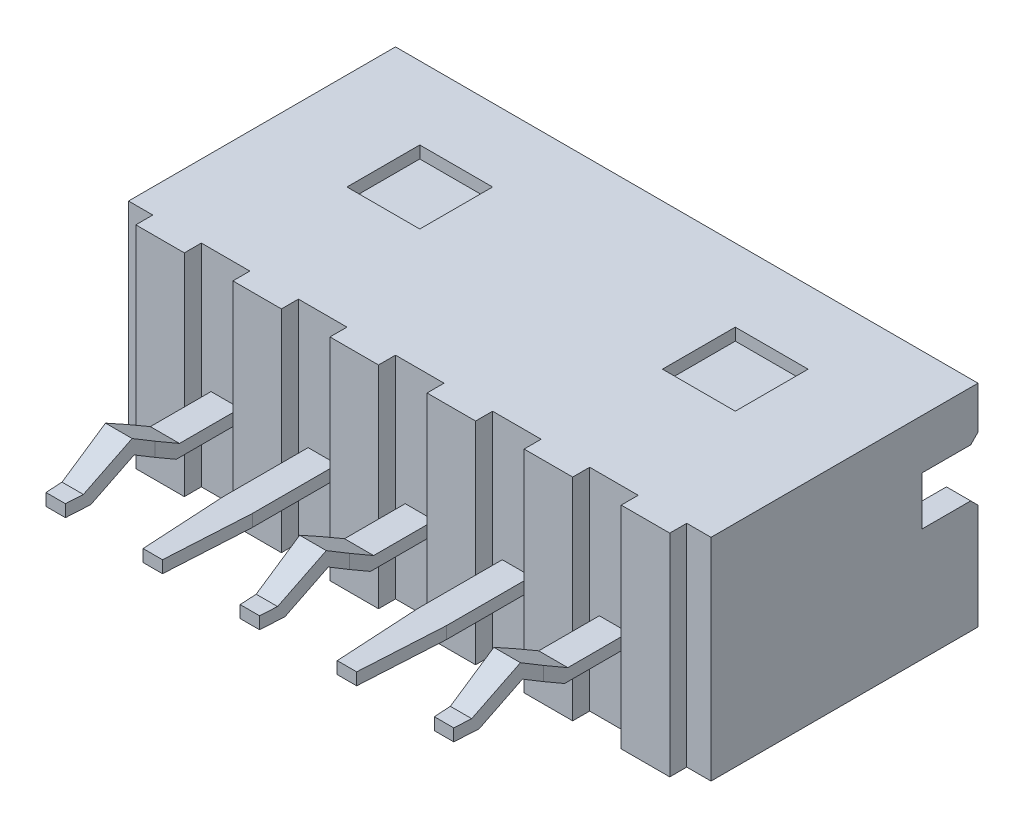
from build123d import *

# Parameters (mm, degrees)
SKETCH1_W           = 12
SKETCH1_H           = 4.35
BOSS_EXTRUDE1_DEPTH = 2.85
SKETCH3_W           = 12
SKETCH3_H           = 4.35
BOSS_EXTRUDE2_DEPTH = 2.65
SKETCH4_W           = 1
SKETCH4_H           = 0.35
BOSS_EXTRUDE3_DEPTH = 4.35
SKETCH5_W           = 0.3
SKETCH5_H           = 1.5
BOSS_EXTRUDE4_DEPTH = 2.85
SKETCH6_W           = 1.5
SKETCH6_H           = 1.5
CUT_EXTRUDE1_DEPTH  = 0.25
CUT_EXTRUDE2_DEPTH  = 0.5
CUT_EXTRUDE3_DEPTH  = 0.5
CUT_EXTRUDE4_START  = -8.3
CUT_EXTRUDE4_DEPTH  = 8.3
CHAMFER6_SIZE       = 0.375
SKETCH10_W          = 0.6
SKETCH10_H          = 3.5
BOSS_EXTRUDE5_DEPTH = 0.8
CUT_EXTRUDE7_REACH  = 15.85
CUT_EXTRUDE8_REACH  = 13.199
CUT_EXTRUDE9_REACH  = 15.85
CUT_EXTRUDE10_REACH = 14.042
SKETCH16_W          = 3.5
SKETCH16_H          = 0.55
CUT_EXTRUDE11_REACH = 14.435
SKETCH17_W          = 3.5
SKETCH17_H          = 0.55
CUT_EXTRUDE12_START = -0.25
CUT_EXTRUDE12_DEPTH = 0.8


with BuildPart() as part:
    # Sketch1 → Boss-Extrude1 (new body)
    with BuildSketch(Plane.XY):
        Rectangle(SKETCH1_W, SKETCH1_H)
        Polygon((-5.5, 1.675), (-5.5, -1.175), (-5.25, -1.175), (-5, -1.675), (5, -1.675), (5.25, -1.175), (5.5, -1.175), (5.5, 1.675), align=None, mode=Mode.SUBTRACT)
    extrude(amount=BOSS_EXTRUDE1_DEPTH)

    # Sketch3 → Boss-Extrude2 (add)
    with BuildSketch(Plane.XY.offset(2.85)):
        Rectangle(SKETCH3_W, SKETCH3_H)
    extrude(amount=BOSS_EXTRUDE2_DEPTH)

    # Sketch4 → Boss-Extrude3 (add)
    with BuildSketch(Plane(origin=(0, 2.175, 0), x_dir=(1, 0, 0), z_dir=(0, 1, 0))):
        with Locations((-5, -5.675)):
            Rectangle(SKETCH4_W, SKETCH4_H)
        with Locations((-3, -5.675)):
            Rectangle(SKETCH4_W, SKETCH4_H)
        with Locations((-1, -5.675)):
            Rectangle(SKETCH4_W, SKETCH4_H)
        with Locations((1, -5.675)):
            Rectangle(SKETCH4_W, SKETCH4_H)
        with Locations((3, -5.675)):
            Rectangle(SKETCH4_W, SKETCH4_H)
        with Locations((5, -5.675)):
            Rectangle(SKETCH4_W, SKETCH4_H)
    extrude(amount=-BOSS_EXTRUDE3_DEPTH)

    # Sketch5 → Boss-Extrude4 (add)
    with BuildSketch(Plane(origin=(0, 0, 2.85), x_dir=(-1, 0, 0), z_dir=(0, 0, -1))):
        with Locations((-4, 0)):
            Rectangle(SKETCH5_W, SKETCH5_H)
        with Locations((-2, 0)):
            Rectangle(SKETCH5_W, SKETCH5_H)
        Rectangle(SKETCH5_W, SKETCH5_H)
        with Locations((2, 0)):
            Rectangle(SKETCH5_W, SKETCH5_H)
        with Locations((4, 0)):
            Rectangle(SKETCH5_W, SKETCH5_H)
    extrude(amount=BOSS_EXTRUDE4_DEPTH)

    # Sketch6 → Cut-Extrude1 (cut)
    with BuildSketch(Plane(origin=(0, 2.175, 0), x_dir=(1, 0, 0), z_dir=(0, 1, 0))):
        with Locations((-3.25, -2.25)):
            Rectangle(SKETCH6_W, SKETCH6_H)
        with Locations((3.25, -2.25)):
            Rectangle(SKETCH6_W, SKETCH6_H)
    extrude(amount=-CUT_EXTRUDE1_DEPTH, mode=Mode.SUBTRACT)

    # Sketch7 → Cut-Extrude2 (cut)
    with BuildSketch(Plane(origin=(6, 0, 0), x_dir=(0, 0, -1), z_dir=(1, 0, 0))):
        Polygon((0, 1.3), (-0.15, 1.15), (-1.15, 1.15), (-1.15, 0.15), (-0.15, 0.15), (0, 0), align=None)
    extrude(amount=-CUT_EXTRUDE2_DEPTH, mode=Mode.SUBTRACT)

    # Sketch8 → Cut-Extrude3 (cut)
    with BuildSketch(Plane.ZY.offset(6)):
        Polygon((0, 1.3), (0.15, 1.15), (1.15, 1.15), (1.15, 0.15), (0.15, 0.15), (0, 0), align=None)
    extrude(amount=-CUT_EXTRUDE3_DEPTH, mode=Mode.SUBTRACT)

    # Sketch9 → Cut-Extrude4 (cut)
    with BuildSketch(Plane(origin=(4.15, 0, 0), x_dir=(0, 0, -1), z_dir=(1, 0, 0)).offset(CUT_EXTRUDE4_START)):
        Polygon((0, -0.5), (-2.165063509, 0.75), (0, 0.75), align=None)
    extrude(amount=CUT_EXTRUDE4_DEPTH, mode=Mode.SUBTRACT)

    # Chamfer6
    chamfer6_edges = [part.edges().sort_by_distance(p)[0] for p in [
        (4, 0.75, 2.165063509),
        (2, 0.75, 2.165063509),
        (0, 0.75, 2.165063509),
        (-2, 0.75, 2.165063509),
        (-4, 0.75, 2.165063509),
    ]]
    chamfer(chamfer6_edges, length=CHAMFER6_SIZE)

    # Sketch10 → Boss-Extrude5 (add)
    with BuildSketch(Plane(origin=(0, -0.625, 0), x_dir=(-1, 0, 0), z_dir=(0, -1, 0))):
        with Locations((4, -7.25)):
            Rectangle(SKETCH10_W, SKETCH10_H)
        with Locations((2, -7.25)):
            Rectangle(SKETCH10_W, SKETCH10_H)
        with Locations((0, -7.25)):
            Rectangle(SKETCH10_W, SKETCH10_H)
        with Locations((-2, -7.25)):
            Rectangle(SKETCH10_W, SKETCH10_H)
        with Locations((-4, -7.25)):
            Rectangle(SKETCH10_W, SKETCH10_H)
    extrude(amount=-BOSS_EXTRUDE5_DEPTH)

    # Sketch13 → Cut-Extrude7 (cut, up to next)
    with BuildSketch(Plane.ZY.offset(4.3), mode=Mode.PRIVATE) as cut_extrude7_sk1:
        Polygon((6.75, -0.375), (7.7, 0.175), (5.5, 0.175), (5.5, -0.375), align=None)
    cut_extrude7_tool1 = extrude(cut_extrude7_sk1.sketch, amount=-CUT_EXTRUDE7_REACH, mode=Mode.PRIVATE) & part.part
    # Sketch13 → Cut-Extrude7 (cut, up to next)
    with BuildSketch(Plane.ZY.offset(4.3), mode=Mode.PRIVATE) as cut_extrude7_sk2:
        Polygon((6.817147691, -0.625), (8.505263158, -0.625), (7.661205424, -0.136334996), align=None)
    cut_extrude7_tool2 = extrude(cut_extrude7_sk2.sketch, amount=-CUT_EXTRUDE7_REACH, mode=Mode.PRIVATE) & part.part
    # Sketch13 → Cut-Extrude7 (cut, up to next)
    with BuildSketch(Plane.ZY.offset(4.3), mode=Mode.PRIVATE) as cut_extrude7_sk3:
        Polygon((8.65, -0.375), (9, -0.375), (9, 0.175), (7.7, 0.175), align=None)
    cut_extrude7_tool3 = extrude(cut_extrude7_sk3.sketch, amount=-CUT_EXTRUDE7_REACH, mode=Mode.PRIVATE) & part.part
    add(cut_extrude7_tool1.solids().sort_by_distance((-4.3, -0.074758, 6.3843))[0], mode=Mode.SUBTRACT)
    add(cut_extrude7_tool2.solids().sort_by_distance((-4.3, -0.462112, 7.661205))[0], mode=Mode.SUBTRACT)
    add(cut_extrude7_tool3.solids().sort_by_distance((-4.3, -0.047222, 8.541919))[0], mode=Mode.SUBTRACT)

    # Sketch14 → Cut-Extrude8 (cut, up to next)
    with BuildSketch(Plane(origin=(0.3, 0, 0), x_dir=(0, 0, -1), z_dir=(1, 0, 0)), mode=Mode.PRIVATE) as cut_extrude8_sk1:
        Polygon((-9, 0.175), (-9, -0.375), (-8.65, -0.375), (-7.7, 0.175), align=None)
    cut_extrude8_tool1 = extrude(cut_extrude8_sk1.sketch, amount=-CUT_EXTRUDE8_REACH, mode=Mode.PRIVATE) & part.part
    # Sketch14 → Cut-Extrude8 (cut, up to next)
    with BuildSketch(Plane(origin=(0.3, 0, 0), x_dir=(0, 0, -1), z_dir=(1, 0, 0)), mode=Mode.PRIVATE) as cut_extrude8_sk2:
        Polygon((-5.5, 0.175), (-7.7, 0.175), (-6.75, -0.375), (-5.5, -0.375), align=None)
    cut_extrude8_tool2 = extrude(cut_extrude8_sk2.sketch, amount=-CUT_EXTRUDE8_REACH, mode=Mode.PRIVATE) & part.part
    # Sketch14 → Cut-Extrude8 (cut, up to next)
    with BuildSketch(Plane(origin=(0.3, 0, 0), x_dir=(0, 0, -1), z_dir=(1, 0, 0)), mode=Mode.PRIVATE) as cut_extrude8_sk3:
        Polygon((-7.661205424, -0.136334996), (-8.505263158, -0.625), (-6.817147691, -0.625), align=None)
    cut_extrude8_tool3 = extrude(cut_extrude8_sk3.sketch, amount=-CUT_EXTRUDE8_REACH, mode=Mode.PRIVATE) & part.part
    add(cut_extrude8_tool1.solids().sort_by_distance((0.3, -0.047222, 8.541919))[0], mode=Mode.SUBTRACT)
    add(cut_extrude8_tool2.solids().sort_by_distance((0.3, -0.074758, 6.3843))[0], mode=Mode.SUBTRACT)
    add(cut_extrude8_tool3.solids().sort_by_distance((0.3, -0.462112, 7.661205))[0], mode=Mode.SUBTRACT)

    # Sketch15 → Cut-Extrude9 (cut, up to next)
    with BuildSketch(Plane(origin=(4.3, 0, 0), x_dir=(0, 0, -1), z_dir=(1, 0, 0)), mode=Mode.PRIVATE) as cut_extrude9_sk1:
        Polygon((-9, 0.175), (-9, -0.375), (-8.65, -0.375), (-7.7, 0.175), align=None)
    cut_extrude9_tool1 = extrude(cut_extrude9_sk1.sketch, amount=-CUT_EXTRUDE9_REACH, mode=Mode.PRIVATE) & part.part
    # Sketch15 → Cut-Extrude9 (cut, up to next)
    with BuildSketch(Plane(origin=(4.3, 0, 0), x_dir=(0, 0, -1), z_dir=(1, 0, 0)), mode=Mode.PRIVATE) as cut_extrude9_sk2:
        Polygon((-5.5, 0.175), (-7.7, 0.175), (-6.75, -0.375), (-5.5, -0.375), align=None)
    cut_extrude9_tool2 = extrude(cut_extrude9_sk2.sketch, amount=-CUT_EXTRUDE9_REACH, mode=Mode.PRIVATE) & part.part
    # Sketch15 → Cut-Extrude9 (cut, up to next)
    with BuildSketch(Plane(origin=(4.3, 0, 0), x_dir=(0, 0, -1), z_dir=(1, 0, 0)), mode=Mode.PRIVATE) as cut_extrude9_sk3:
        Polygon((-7.661205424, -0.136334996), (-8.505263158, -0.625), (-6.817147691, -0.625), align=None)
    cut_extrude9_tool3 = extrude(cut_extrude9_sk3.sketch, amount=-CUT_EXTRUDE9_REACH, mode=Mode.PRIVATE) & part.part
    add(cut_extrude9_tool1.solids().sort_by_distance((4.3, -0.047222, 8.541919))[0], mode=Mode.SUBTRACT)
    add(cut_extrude9_tool2.solids().sort_by_distance((4.3, -0.074758, 6.3843))[0], mode=Mode.SUBTRACT)
    add(cut_extrude9_tool3.solids().sort_by_distance((4.3, -0.462112, 7.661205))[0], mode=Mode.SUBTRACT)

    # Sketch16 → Cut-Extrude10 (cut, up to next)
    with BuildSketch(Plane(origin=(-1.7, 0, 0), x_dir=(0, 0, -1), z_dir=(1, 0, 0)), mode=Mode.PRIVATE) as cut_extrude10_sk1:
        with Locations((-7.25, -0.1)):
            Rectangle(SKETCH16_W, SKETCH16_H)
    cut_extrude10_tool1 = extrude(cut_extrude10_sk1.sketch, amount=-CUT_EXTRUDE10_REACH, mode=Mode.PRIVATE) & part.part
    add(cut_extrude10_tool1.solids().sort_by_distance((-1.7, -0.1, 7.25))[0], mode=Mode.SUBTRACT)

    # Sketch17 → Cut-Extrude11 (cut, up to next)
    with BuildSketch(Plane(origin=(2.3, 0, 0), x_dir=(0, 0, -1), z_dir=(1, 0, 0)), mode=Mode.PRIVATE) as cut_extrude11_sk1:
        with Locations((-7.25, -0.1)):
            Rectangle(SKETCH17_W, SKETCH17_H)
    cut_extrude11_tool1 = extrude(cut_extrude11_sk1.sketch, amount=-CUT_EXTRUDE11_REACH, mode=Mode.PRIVATE) & part.part
    add(cut_extrude11_tool1.solids().sort_by_distance((2.3, -0.1, 7.25))[0], mode=Mode.SUBTRACT)

    # Sketch18 → Cut-Extrude12 (cut)
    with BuildSketch(Plane(origin=(0, -0.375, 0), x_dir=(1, 0, 0), z_dir=(0, 1, 0)).offset(CUT_EXTRUDE12_START)):
        Polygon((-2.3, -7.25), (-2.2, -9), (-1.8, -9), (-1.7, -7.25), (-0.3, -7.25), (-0.2, -9), (0.2, -9), (0.3, -7.25), (1.7, -7.25), (1.8, -9), (2.2, -9), (2.3, -7.25), (3.7, -7.25), (3.8, -9), (4.2, -9), (4.3, -7.25), (4.3, -9.1), (-4.3, -9.1), (-4.3, -7.25), (-4.2, -9), (-3.8, -9), (-3.7, -7.25), align=None)
    extrude(amount=CUT_EXTRUDE12_DEPTH, mode=Mode.SUBTRACT)


solid = part.part
